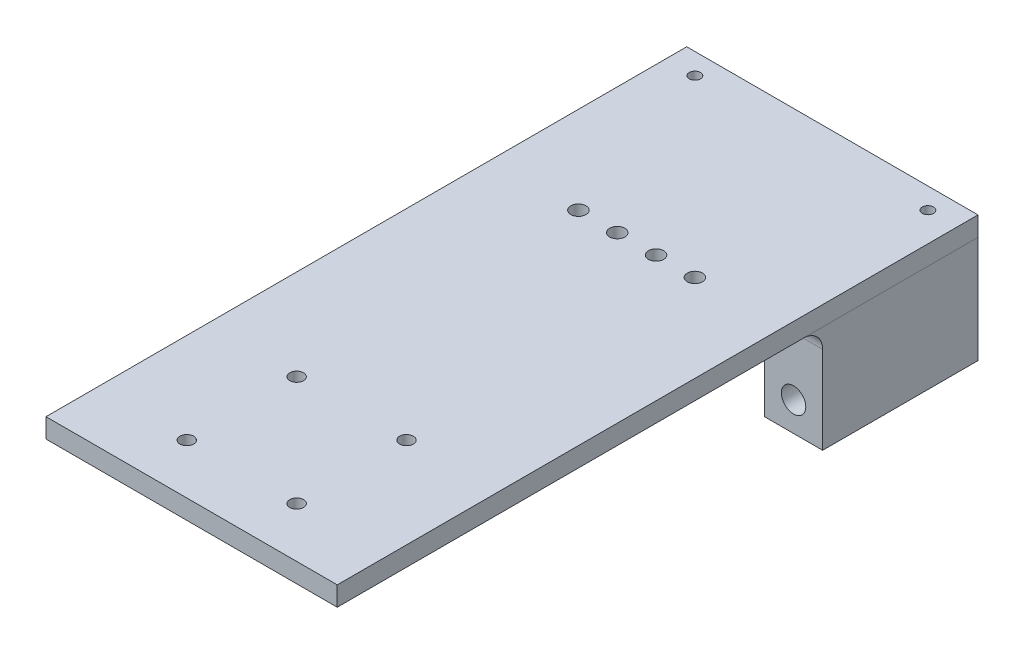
ISO-10303-21;
HEADER;
FILE_DESCRIPTION(('STEP AP214'),'2;1');
FILE_NAME('part.step','',(''),(''),'','','');
FILE_SCHEMA(('AUTOMOTIVE_DESIGN { 1 0 10303 214 1 1 1 1 }'));
ENDSEC;
DATA;
#1=APPLICATION_CONTEXT('core data for automotive mechanical design processes');
#2=APPLICATION_PROTOCOL_DEFINITION('international standard','automotive_design',2000,#1);
#3=PRODUCT_CONTEXT('',#1,'mechanical');
#4=PRODUCT('Part','Part','',(#3));
#5=PRODUCT_RELATED_PRODUCT_CATEGORY('part','',(#4));
#6=PRODUCT_DEFINITION_FORMATION('','',#4);
#7=PRODUCT_DEFINITION_CONTEXT('part definition',#1,'design');
#8=PRODUCT_DEFINITION('design','',#6,#7);
#9=PRODUCT_DEFINITION_SHAPE('','',#8);
#10=(LENGTH_UNIT() NAMED_UNIT(*) SI_UNIT(.MILLI.,.METRE.));
#11=(NAMED_UNIT(*) PLANE_ANGLE_UNIT() SI_UNIT($,.RADIAN.));
#12=(NAMED_UNIT(*) SI_UNIT($,.STERADIAN.) SOLID_ANGLE_UNIT());
#13=UNCERTAINTY_MEASURE_WITH_UNIT(LENGTH_MEASURE(1.E-05),#10,'distance_accuracy_value','');
#14=(GEOMETRIC_REPRESENTATION_CONTEXT(3) GLOBAL_UNCERTAINTY_ASSIGNED_CONTEXT((#13)) GLOBAL_UNIT_ASSIGNED_CONTEXT((#10,
#11,#12)) REPRESENTATION_CONTEXT('',''));
#15=CARTESIAN_POINT('',(0.,0.,0.));
#16=DIRECTION('',(0.,0.,1.));
#17=DIRECTION('',(1.,0.,0.));
#18=AXIS2_PLACEMENT_3D('',#15,#16,#17);
#19=CARTESIAN_POINT('',(-47.625,-6.35,31.7500000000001));
#20=DIRECTION('',(0.,-1.,0.));
#21=DIRECTION('',(0.,0.,-1.));
#22=AXIS2_PLACEMENT_3D('',#19,#20,#21);
#23=PLANE('',#22);
#24=CARTESIAN_POINT('',(-38.1,-6.35,-18.542));
#25=DIRECTION('',(0.,-1.,0.));
#26=DIRECTION('',(0.,0.,-1.));
#27=AXIS2_PLACEMENT_3D('',#24,#25,#26);
#28=CIRCLE('',#27,1.8288);
#29=CARTESIAN_POINT('',(-38.1,-6.35,-20.3708));
#30=VERTEX_POINT('',#29);
#31=EDGE_CURVE('E108',#30,#30,#28,.F.);
#32=ORIENTED_EDGE('',*,*,#31,.T.);
#33=EDGE_LOOP('',(#32));
#34=FACE_BOUND('',#33,.T.);
#35=CARTESIAN_POINT('',(38.1,-6.35,-18.542));
#36=DIRECTION('',(0.,-1.,0.));
#37=DIRECTION('',(0.,0.,-1.));
#38=AXIS2_PLACEMENT_3D('',#35,#36,#37);
#39=CIRCLE('',#38,1.8288);
#40=CARTESIAN_POINT('',(38.1,-6.35,-20.3708));
#41=VERTEX_POINT('',#40);
#42=EDGE_CURVE('E107',#41,#41,#39,.T.);
#43=ORIENTED_EDGE('',*,*,#42,.F.);
#44=EDGE_LOOP('',(#43));
#45=FACE_BOUND('',#44,.T.);
#46=DIRECTION('',(-1.,0.,0.));
#47=VECTOR('',#46,1.);
#48=CARTESIAN_POINT('',(0.,-6.35,-25.4));
#49=LINE('',#48,#47);
#50=CARTESIAN_POINT('',(47.625,-6.35,-25.4));
#51=VERTEX_POINT('',#50);
#52=CARTESIAN_POINT('',(-47.625,-6.35,-25.4));
#53=VERTEX_POINT('',#52);
#54=EDGE_CURVE('E93',#51,#53,#49,.T.);
#55=ORIENTED_EDGE('',*,*,#54,.F.);
#56=DIRECTION('',(0.,0.,-1.));
#57=VECTOR('',#56,1.);
#58=CARTESIAN_POINT('',(47.625,-6.35,184.15));
#59=LINE('',#58,#57);
#60=CARTESIAN_POINT('',(47.625,-6.35,184.15));
#61=VERTEX_POINT('',#60);
#62=EDGE_CURVE('E99',#61,#51,#59,.T.);
#63=ORIENTED_EDGE('',*,*,#62,.F.);
#64=DIRECTION('',(1.,0.,0.));
#65=VECTOR('',#64,1.);
#66=CARTESIAN_POINT('',(-47.625,-6.35,184.15));
#67=LINE('',#66,#65);
#68=CARTESIAN_POINT('',(-47.625,-6.35,184.15));
#69=VERTEX_POINT('',#68);
#70=EDGE_CURVE('E67',#69,#61,#67,.T.);
#71=ORIENTED_EDGE('',*,*,#70,.F.);
#72=DIRECTION('',(0.,0.,-1.));
#73=VECTOR('',#72,1.);
#74=CARTESIAN_POINT('',(-47.625,-6.35,184.15));
#75=LINE('',#74,#73);
#76=EDGE_CURVE('E90',#69,#53,#75,.T.);
#77=ORIENTED_EDGE('',*,*,#76,.T.);
#78=EDGE_LOOP('',(#55,#63,#71,#77));
#79=FACE_BOUND('',#78,.T.);
#80=CARTESIAN_POINT('',(6.34999999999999,-6.35,38.608));
#81=DIRECTION('',(0.,1.,0.));
#82=DIRECTION('',(0.,0.,1.));
#83=AXIS2_PLACEMENT_3D('',#80,#81,#82);
#84=CIRCLE('',#83,2.4892);
#85=CARTESIAN_POINT('',(6.34999999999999,-6.35,41.0972));
#86=VERTEX_POINT('',#85);
#87=EDGE_CURVE('E140',#86,#86,#84,.F.);
#88=ORIENTED_EDGE('',*,*,#87,.F.);
#89=EDGE_LOOP('',(#88));
#90=FACE_BOUND('',#89,.T.);
#91=CARTESIAN_POINT('',(19.05,-6.35,38.608));
#92=DIRECTION('',(0.,1.,0.));
#93=DIRECTION('',(0.,0.,1.));
#94=AXIS2_PLACEMENT_3D('',#91,#92,#93);
#95=CIRCLE('',#94,2.4892);
#96=CARTESIAN_POINT('',(19.05,-6.35,41.0972));
#97=VERTEX_POINT('',#96);
#98=EDGE_CURVE('E129',#97,#97,#95,.F.);
#99=ORIENTED_EDGE('',*,*,#98,.F.);
#100=EDGE_LOOP('',(#99));
#101=FACE_BOUND('',#100,.T.);
#102=CARTESIAN_POINT('',(-6.34999999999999,-6.35,38.608));
#103=DIRECTION('',(0.,1.,0.));
#104=DIRECTION('',(0.,0.,1.));
#105=AXIS2_PLACEMENT_3D('',#102,#103,#104);
#106=CIRCLE('',#105,2.4892);
#107=CARTESIAN_POINT('',(-6.34999999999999,-6.35,41.0972));
#108=VERTEX_POINT('',#107);
#109=EDGE_CURVE('E145',#108,#108,#106,.T.);
#110=ORIENTED_EDGE('',*,*,#109,.T.);
#111=EDGE_LOOP('',(#110));
#112=FACE_BOUND('',#111,.T.);
#113=CARTESIAN_POINT('',(-19.05,-6.35,38.608));
#114=DIRECTION('',(0.,1.,0.));
#115=DIRECTION('',(0.,0.,1.));
#116=AXIS2_PLACEMENT_3D('',#113,#114,#115);
#117=CIRCLE('',#116,2.4892);
#118=CARTESIAN_POINT('',(-19.05,-6.35,41.0972));
#119=VERTEX_POINT('',#118);
#120=EDGE_CURVE('E136',#119,#119,#117,.T.);
#121=ORIENTED_EDGE('',*,*,#120,.T.);
#122=EDGE_LOOP('',(#121));
#123=FACE_BOUND('',#122,.T.);
#124=CARTESIAN_POINT('',(-17.9605122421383,-6.35,131.845975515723));
#125=DIRECTION('',(0.,1.,0.));
#126=DIRECTION('',(0.,0.,1.));
#127=AXIS2_PLACEMENT_3D('',#124,#125,#126);
#128=CIRCLE('',#127,2.24789999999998);
#129=CARTESIAN_POINT('',(-20.2084122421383,-6.35,131.845975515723));
#130=VERTEX_POINT('',#129);
#131=EDGE_CURVE('E156',#130,#130,#128,.F.);
#132=ORIENTED_EDGE('',*,*,#131,.F.);
#133=EDGE_LOOP('',(#132));
#134=FACE_BOUND('',#133,.T.);
#135=CARTESIAN_POINT('',(17.9605122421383,-6.35,167.767));
#136=DIRECTION('',(0.,1.,0.));
#137=DIRECTION('',(0.,0.,1.));
#138=AXIS2_PLACEMENT_3D('',#135,#136,#137);
#139=CIRCLE('',#138,2.24789999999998);
#140=CARTESIAN_POINT('',(15.7126122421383,-6.35,167.767));
#141=VERTEX_POINT('',#140);
#142=EDGE_CURVE('E155',#141,#141,#139,.F.);
#143=ORIENTED_EDGE('',*,*,#142,.F.);
#144=EDGE_LOOP('',(#143));
#145=FACE_BOUND('',#144,.T.);
#146=CARTESIAN_POINT('',(17.9605122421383,-6.35,131.845975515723));
#147=DIRECTION('',(0.,1.,0.));
#148=DIRECTION('',(0.,0.,1.));
#149=AXIS2_PLACEMENT_3D('',#146,#147,#148);
#150=CIRCLE('',#149,2.24789999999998);
#151=CARTESIAN_POINT('',(15.7126122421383,-6.35,131.845975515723));
#152=VERTEX_POINT('',#151);
#153=EDGE_CURVE('E146',#152,#152,#150,.F.);
#154=ORIENTED_EDGE('',*,*,#153,.F.);
#155=EDGE_LOOP('',(#154));
#156=FACE_BOUND('',#155,.T.);
#157=CARTESIAN_POINT('',(-17.9605122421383,-6.35,167.767));
#158=DIRECTION('',(0.,1.,0.));
#159=DIRECTION('',(0.,0.,1.));
#160=AXIS2_PLACEMENT_3D('',#157,#158,#159);
#161=CIRCLE('',#160,2.24789999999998);
#162=CARTESIAN_POINT('',(-20.2084122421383,-6.35,167.767));
#163=VERTEX_POINT('',#162);
#164=EDGE_CURVE('E170',#163,#163,#161,.F.);
#165=ORIENTED_EDGE('',*,*,#164,.F.);
#166=EDGE_LOOP('',(#165));
#167=FACE_BOUND('',#166,.T.);
#168=ADVANCED_FACE('F49',(#34,#45,#79,#90,#101,#112,#123,#134,#145,#156,#167),#23,.T.);
#169=CARTESIAN_POINT('',(0.,0.,-25.4));
#170=DIRECTION('',(0.,0.,-1.));
#171=DIRECTION('',(-1.,0.,0.));
#172=AXIS2_PLACEMENT_3D('',#169,#170,#171);
#173=PLANE('',#172);
#174=DIRECTION('',(0.,1.,0.));
#175=VECTOR('',#174,1.);
#176=CARTESIAN_POINT('',(47.625,0.,-25.4));
#177=LINE('',#176,#175);
#178=CARTESIAN_POINT('',(47.625,0.,-25.4));
#179=VERTEX_POINT('',#178);
#180=EDGE_CURVE('E53',#51,#179,#177,.T.);
#181=ORIENTED_EDGE('',*,*,#180,.F.);
#182=ORIENTED_EDGE('',*,*,#54,.T.);
#183=DIRECTION('',(0.,-1.,0.));
#184=VECTOR('',#183,1.);
#185=CARTESIAN_POINT('',(-47.625,0.,-25.4));
#186=LINE('',#185,#184);
#187=CARTESIAN_POINT('',(-47.625,0.,-25.4));
#188=VERTEX_POINT('',#187);
#189=EDGE_CURVE('E105',#188,#53,#186,.T.);
#190=ORIENTED_EDGE('',*,*,#189,.F.);
#191=DIRECTION('',(-1.,0.,0.));
#192=VECTOR('',#191,1.);
#193=CARTESIAN_POINT('',(-47.625,0.,-25.4));
#194=LINE('',#193,#192);
#195=EDGE_CURVE('E114',#179,#188,#194,.T.);
#196=ORIENTED_EDGE('',*,*,#195,.F.);
#197=EDGE_LOOP('',(#181,#182,#190,#196));
#198=FACE_BOUND('',#197,.T.);
#199=ADVANCED_FACE('F103',(#198),#173,.T.);
#200=CARTESIAN_POINT('',(-47.625,0.,25.4));
#201=DIRECTION('',(0.,-1.,0.));
#202=DIRECTION('',(1.,0.,0.));
#203=AXIS2_PLACEMENT_3D('',#200,#201,#202);
#204=PLANE('',#203);
#205=CARTESIAN_POINT('',(6.35,0.,38.608));
#206=DIRECTION('',(0.,-1.,0.));
#207=DIRECTION('',(1.,0.,0.));
#208=AXIS2_PLACEMENT_3D('',#205,#206,#207);
#209=CIRCLE('',#208,2.4892);
#210=CARTESIAN_POINT('',(8.8392,0.,38.608));
#211=VERTEX_POINT('',#210);
#212=EDGE_CURVE('E59',#211,#211,#209,.T.);
#213=ORIENTED_EDGE('',*,*,#212,.T.);
#214=EDGE_LOOP('',(#213));
#215=FACE_BOUND('',#214,.T.);
#216=CARTESIAN_POINT('',(19.05,0.,38.608));
#217=DIRECTION('',(0.,-1.,0.));
#218=DIRECTION('',(1.,0.,0.));
#219=AXIS2_PLACEMENT_3D('',#216,#217,#218);
#220=CIRCLE('',#219,2.4892);
#221=CARTESIAN_POINT('',(21.5392,0.,38.608));
#222=VERTEX_POINT('',#221);
#223=EDGE_CURVE('E12',#222,#222,#220,.T.);
#224=ORIENTED_EDGE('',*,*,#223,.T.);
#225=EDGE_LOOP('',(#224));
#226=FACE_BOUND('',#225,.T.);
#227=CARTESIAN_POINT('',(-6.35,0.,38.608));
#228=DIRECTION('',(0.,1.,0.));
#229=DIRECTION('',(-1.,0.,0.));
#230=AXIS2_PLACEMENT_3D('',#227,#228,#229);
#231=CIRCLE('',#230,2.4892);
#232=CARTESIAN_POINT('',(-8.8392,0.,38.608));
#233=VERTEX_POINT('',#232);
#234=EDGE_CURVE('E131',#233,#233,#231,.T.);
#235=ORIENTED_EDGE('',*,*,#234,.F.);
#236=EDGE_LOOP('',(#235));
#237=FACE_BOUND('',#236,.T.);
#238=CARTESIAN_POINT('',(-19.05,0.,38.608));
#239=DIRECTION('',(0.,1.,0.));
#240=DIRECTION('',(-1.,0.,0.));
#241=AXIS2_PLACEMENT_3D('',#238,#239,#240);
#242=CIRCLE('',#241,2.4892);
#243=CARTESIAN_POINT('',(-21.5392,0.,38.608));
#244=VERTEX_POINT('',#243);
#245=EDGE_CURVE('E135',#244,#244,#242,.T.);
#246=ORIENTED_EDGE('',*,*,#245,.F.);
#247=EDGE_LOOP('',(#246));
#248=FACE_BOUND('',#247,.T.);
#249=CARTESIAN_POINT('',(-17.9605122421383,0.,131.845975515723));
#250=DIRECTION('',(0.,1.,0.));
#251=DIRECTION('',(-1.,0.,0.));
#252=AXIS2_PLACEMENT_3D('',#249,#250,#251);
#253=CIRCLE('',#252,2.24789999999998);
#254=CARTESIAN_POINT('',(-20.2084122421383,0.,131.845975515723));
#255=VERTEX_POINT('',#254);
#256=EDGE_CURVE('E151',#255,#255,#253,.T.);
#257=ORIENTED_EDGE('',*,*,#256,.F.);
#258=EDGE_LOOP('',(#257));
#259=FACE_BOUND('',#258,.T.);
#260=CARTESIAN_POINT('',(17.9605122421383,0.,167.767));
#261=DIRECTION('',(0.,1.,0.));
#262=DIRECTION('',(-1.,0.,0.));
#263=AXIS2_PLACEMENT_3D('',#260,#261,#262);
#264=CIRCLE('',#263,2.24789999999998);
#265=CARTESIAN_POINT('',(15.7126122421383,0.,167.767));
#266=VERTEX_POINT('',#265);
#267=EDGE_CURVE('E150',#266,#266,#264,.T.);
#268=ORIENTED_EDGE('',*,*,#267,.F.);
#269=EDGE_LOOP('',(#268));
#270=FACE_BOUND('',#269,.T.);
#271=CARTESIAN_POINT('',(17.9605122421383,0.,131.845975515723));
#272=DIRECTION('',(0.,1.,0.));
#273=DIRECTION('',(-1.,0.,0.));
#274=AXIS2_PLACEMENT_3D('',#271,#272,#273);
#275=CIRCLE('',#274,2.24789999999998);
#276=CARTESIAN_POINT('',(15.7126122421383,0.,131.845975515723));
#277=VERTEX_POINT('',#276);
#278=EDGE_CURVE('E141',#277,#277,#275,.T.);
#279=ORIENTED_EDGE('',*,*,#278,.F.);
#280=EDGE_LOOP('',(#279));
#281=FACE_BOUND('',#280,.T.);
#282=CARTESIAN_POINT('',(-17.9605122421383,0.,167.767));
#283=DIRECTION('',(0.,1.,0.));
#284=DIRECTION('',(-1.,0.,0.));
#285=AXIS2_PLACEMENT_3D('',#282,#283,#284);
#286=CIRCLE('',#285,2.24789999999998);
#287=CARTESIAN_POINT('',(-20.2084122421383,0.,167.767));
#288=VERTEX_POINT('',#287);
#289=EDGE_CURVE('E160',#288,#288,#286,.T.);
#290=ORIENTED_EDGE('',*,*,#289,.F.);
#291=EDGE_LOOP('',(#290));
#292=FACE_BOUND('',#291,.T.);
#293=CARTESIAN_POINT('',(38.1,0.,-18.542));
#294=DIRECTION('',(0.,-1.,0.));
#295=DIRECTION('',(1.,0.,0.));
#296=AXIS2_PLACEMENT_3D('',#293,#294,#295);
#297=CIRCLE('',#296,1.8288);
#298=CARTESIAN_POINT('',(39.9288,0.,-18.542));
#299=VERTEX_POINT('',#298);
#300=EDGE_CURVE('E174',#299,#299,#297,.T.);
#301=ORIENTED_EDGE('',*,*,#300,.T.);
#302=EDGE_LOOP('',(#301));
#303=FACE_BOUND('',#302,.T.);
#304=CARTESIAN_POINT('',(-38.1,0.,-18.542));
#305=DIRECTION('',(0.,1.,0.));
#306=DIRECTION('',(-1.,0.,0.));
#307=AXIS2_PLACEMENT_3D('',#304,#305,#306);
#308=CIRCLE('',#307,1.8288);
#309=CARTESIAN_POINT('',(-39.9288,0.,-18.542));
#310=VERTEX_POINT('',#309);
#311=EDGE_CURVE('E178',#310,#310,#308,.T.);
#312=ORIENTED_EDGE('',*,*,#311,.F.);
#313=EDGE_LOOP('',(#312));
#314=FACE_BOUND('',#313,.T.);
#315=ORIENTED_EDGE('',*,*,#195,.T.);
#316=DIRECTION('',(0.,0.,-1.));
#317=VECTOR('',#316,1.);
#318=CARTESIAN_POINT('',(-47.625,0.,25.4));
#319=LINE('',#318,#317);
#320=CARTESIAN_POINT('',(-47.625,0.,184.15));
#321=VERTEX_POINT('',#320);
#322=EDGE_CURVE('E112',#321,#188,#319,.T.);
#323=ORIENTED_EDGE('',*,*,#322,.F.);
#324=DIRECTION('',(-1.,0.,0.));
#325=VECTOR('',#324,1.);
#326=CARTESIAN_POINT('',(-47.625,0.,184.15));
#327=LINE('',#326,#325);
#328=CARTESIAN_POINT('',(47.625,0.,184.15));
#329=VERTEX_POINT('',#328);
#330=EDGE_CURVE('E190',#329,#321,#327,.T.);
#331=ORIENTED_EDGE('',*,*,#330,.F.);
#332=DIRECTION('',(0.,0.,-1.));
#333=VECTOR('',#332,1.);
#334=CARTESIAN_POINT('',(47.625,0.,25.4));
#335=LINE('',#334,#333);
#336=EDGE_CURVE('E118',#329,#179,#335,.T.);
#337=ORIENTED_EDGE('',*,*,#336,.T.);
#338=EDGE_LOOP('',(#315,#323,#331,#337));
#339=FACE_BOUND('',#338,.T.);
#340=ADVANCED_FACE('F240',(#215,#226,#237,#248,#259,#270,#281,#292,#303,#314,#339),#204,.F.);
#341=CARTESIAN_POINT('',(6.34999999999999,-41.275,38.608));
#342=DIRECTION('',(0.,1.,0.));
#343=DIRECTION('',(-1.,0.,0.));
#344=AXIS2_PLACEMENT_3D('',#341,#342,#343);
#345=CYLINDRICAL_SURFACE('',#344,2.4892);
#346=ORIENTED_EDGE('',*,*,#212,.F.);
#347=EDGE_LOOP('',(#346));
#348=FACE_BOUND('',#347,.T.);
#349=ORIENTED_EDGE('',*,*,#87,.T.);
#350=EDGE_LOOP('',(#349));
#351=FACE_BOUND('',#350,.T.);
#352=ADVANCED_FACE('F212',(#348,#351),#345,.F.);
#353=CARTESIAN_POINT('',(19.05,-41.275,38.608));
#354=DIRECTION('',(0.,1.,0.));
#355=DIRECTION('',(-1.,0.,0.));
#356=AXIS2_PLACEMENT_3D('',#353,#354,#355);
#357=CYLINDRICAL_SURFACE('',#356,2.4892);
#358=ORIENTED_EDGE('',*,*,#223,.F.);
#359=EDGE_LOOP('',(#358));
#360=FACE_BOUND('',#359,.T.);
#361=ORIENTED_EDGE('',*,*,#98,.T.);
#362=EDGE_LOOP('',(#361));
#363=FACE_BOUND('',#362,.T.);
#364=ADVANCED_FACE('F321',(#360,#363),#357,.F.);
#365=CARTESIAN_POINT('',(-6.34999999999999,-41.275,38.608));
#366=DIRECTION('',(0.,1.,0.));
#367=DIRECTION('',(-1.,0.,0.));
#368=AXIS2_PLACEMENT_3D('',#365,#366,#367);
#369=CYLINDRICAL_SURFACE('',#368,2.4892);
#370=ORIENTED_EDGE('',*,*,#234,.T.);
#371=EDGE_LOOP('',(#370));
#372=FACE_BOUND('',#371,.T.);
#373=ORIENTED_EDGE('',*,*,#109,.F.);
#374=EDGE_LOOP('',(#373));
#375=FACE_BOUND('',#374,.T.);
#376=ADVANCED_FACE('F331',(#372,#375),#369,.F.);
#377=CARTESIAN_POINT('',(-19.05,-41.275,38.608));
#378=DIRECTION('',(0.,1.,0.));
#379=DIRECTION('',(-1.,0.,0.));
#380=AXIS2_PLACEMENT_3D('',#377,#378,#379);
#381=CYLINDRICAL_SURFACE('',#380,2.4892);
#382=ORIENTED_EDGE('',*,*,#245,.T.);
#383=EDGE_LOOP('',(#382));
#384=FACE_BOUND('',#383,.T.);
#385=ORIENTED_EDGE('',*,*,#120,.F.);
#386=EDGE_LOOP('',(#385));
#387=FACE_BOUND('',#386,.T.);
#388=ADVANCED_FACE('F341',(#384,#387),#381,.F.);
#389=CARTESIAN_POINT('',(-17.9605122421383,-12.7080213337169,131.845975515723));
#390=DIRECTION('',(0.,1.,0.));
#391=DIRECTION('',(-1.,0.,0.));
#392=AXIS2_PLACEMENT_3D('',#389,#390,#391);
#393=CYLINDRICAL_SURFACE('',#392,2.24789999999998);
#394=CARTESIAN_POINT('',(-20.2084122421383,-6.35,131.845975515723));
#395=CARTESIAN_POINT('',(-20.2084122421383,-6.28385416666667,131.845975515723));
#396=CARTESIAN_POINT('',(-20.2084122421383,-6.21770833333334,131.845975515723));
#397=CARTESIAN_POINT('',(-20.2084122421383,-6.08541666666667,131.845975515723));
#398=CARTESIAN_POINT('',(-20.2084122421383,-6.01927083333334,131.845975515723));
#399=CARTESIAN_POINT('',(-20.2084122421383,-5.88697916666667,131.845975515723));
#400=CARTESIAN_POINT('',(-20.2084122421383,-5.82083333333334,131.845975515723));
#401=CARTESIAN_POINT('',(-20.2084122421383,-5.68854166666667,131.845975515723));
#402=CARTESIAN_POINT('',(-20.2084122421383,-5.62239583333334,131.845975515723));
#403=CARTESIAN_POINT('',(-20.2084122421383,-5.49010416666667,131.845975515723));
#404=CARTESIAN_POINT('',(-20.2084122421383,-5.42395833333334,131.845975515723));
#405=CARTESIAN_POINT('',(-20.2084122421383,-5.29166666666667,131.845975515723));
#406=CARTESIAN_POINT('',(-20.2084122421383,-5.22552083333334,131.845975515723));
#407=CARTESIAN_POINT('',(-20.2084122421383,-5.09322916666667,131.845975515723));
#408=CARTESIAN_POINT('',(-20.2084122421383,-5.02708333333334,131.845975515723));
#409=CARTESIAN_POINT('',(-20.2084122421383,-4.89479166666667,131.845975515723));
#410=CARTESIAN_POINT('',(-20.2084122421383,-4.82864583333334,131.845975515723));
#411=CARTESIAN_POINT('',(-20.2084122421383,-4.69635416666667,131.845975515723));
#412=CARTESIAN_POINT('',(-20.2084122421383,-4.63020833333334,131.845975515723));
#413=CARTESIAN_POINT('',(-20.2084122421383,-4.49791666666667,131.845975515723));
#414=CARTESIAN_POINT('',(-20.2084122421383,-4.43177083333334,131.845975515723));
#415=CARTESIAN_POINT('',(-20.2084122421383,-4.29947916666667,131.845975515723));
#416=CARTESIAN_POINT('',(-20.2084122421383,-4.23333333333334,131.845975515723));
#417=CARTESIAN_POINT('',(-20.2084122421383,-4.10104166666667,131.845975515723));
#418=CARTESIAN_POINT('',(-20.2084122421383,-4.03489583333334,131.845975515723));
#419=CARTESIAN_POINT('',(-20.2084122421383,-3.90260416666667,131.845975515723));
#420=CARTESIAN_POINT('',(-20.2084122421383,-3.83645833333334,131.845975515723));
#421=CARTESIAN_POINT('',(-20.2084122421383,-3.70416666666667,131.845975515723));
#422=CARTESIAN_POINT('',(-20.2084122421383,-3.63802083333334,131.845975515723));
#423=CARTESIAN_POINT('',(-20.2084122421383,-3.50572916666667,131.845975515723));
#424=CARTESIAN_POINT('',(-20.2084122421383,-3.43958333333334,131.845975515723));
#425=CARTESIAN_POINT('',(-20.2084122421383,-3.30729166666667,131.845975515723));
#426=CARTESIAN_POINT('',(-20.2084122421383,-3.24114583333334,131.845975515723));
#427=CARTESIAN_POINT('',(-20.2084122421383,-3.10885416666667,131.845975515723));
#428=CARTESIAN_POINT('',(-20.2084122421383,-3.04270833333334,131.845975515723));
#429=CARTESIAN_POINT('',(-20.2084122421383,-2.91041666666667,131.845975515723));
#430=CARTESIAN_POINT('',(-20.2084122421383,-2.84427083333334,131.845975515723));
#431=CARTESIAN_POINT('',(-20.2084122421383,-2.71197916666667,131.845975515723));
#432=CARTESIAN_POINT('',(-20.2084122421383,-2.64583333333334,131.845975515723));
#433=CARTESIAN_POINT('',(-20.2084122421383,-2.51354166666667,131.845975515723));
#434=CARTESIAN_POINT('',(-20.2084122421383,-2.44739583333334,131.845975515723));
#435=CARTESIAN_POINT('',(-20.2084122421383,-2.31510416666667,131.845975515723));
#436=CARTESIAN_POINT('',(-20.2084122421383,-2.24895833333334,131.845975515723));
#437=CARTESIAN_POINT('',(-20.2084122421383,-2.11666666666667,131.845975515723));
#438=CARTESIAN_POINT('',(-20.2084122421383,-2.05052083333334,131.845975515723));
#439=CARTESIAN_POINT('',(-20.2084122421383,-1.91822916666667,131.845975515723));
#440=CARTESIAN_POINT('',(-20.2084122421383,-1.85208333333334,131.845975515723));
#441=CARTESIAN_POINT('',(-20.2084122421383,-1.71979166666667,131.845975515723));
#442=CARTESIAN_POINT('',(-20.2084122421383,-1.65364583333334,131.845975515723));
#443=CARTESIAN_POINT('',(-20.2084122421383,-1.52135416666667,131.845975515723));
#444=CARTESIAN_POINT('',(-20.2084122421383,-1.45520833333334,131.845975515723));
#445=CARTESIAN_POINT('',(-20.2084122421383,-1.32291666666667,131.845975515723));
#446=CARTESIAN_POINT('',(-20.2084122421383,-1.25677083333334,131.845975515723));
#447=CARTESIAN_POINT('',(-20.2084122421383,-1.12447916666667,131.845975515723));
#448=CARTESIAN_POINT('',(-20.2084122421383,-1.05833333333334,131.845975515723));
#449=CARTESIAN_POINT('',(-20.2084122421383,-0.926041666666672,131.845975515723));
#450=CARTESIAN_POINT('',(-20.2084122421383,-0.859895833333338,131.845975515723));
#451=CARTESIAN_POINT('',(-20.2084122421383,-0.727604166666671,131.845975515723));
#452=CARTESIAN_POINT('',(-20.2084122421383,-0.661458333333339,131.845975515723));
#453=CARTESIAN_POINT('',(-20.2084122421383,-0.529166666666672,131.845975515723));
#454=CARTESIAN_POINT('',(-20.2084122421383,-0.463020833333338,131.845975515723));
#455=CARTESIAN_POINT('',(-20.2084122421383,-0.330729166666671,131.845975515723));
#456=CARTESIAN_POINT('',(-20.2084122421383,-0.264583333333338,131.845975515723));
#457=CARTESIAN_POINT('',(-20.2084122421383,-0.132291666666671,131.845975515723));
#458=CARTESIAN_POINT('',(-20.2084122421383,-0.0661458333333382,131.845975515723));
#459=CARTESIAN_POINT('',(-20.2084122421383,0.,131.845975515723));
#460=B_SPLINE_CURVE_WITH_KNOTS('',3,(#394,#395,#396,#397,#398,#399,#400,#401,#402,#403,#404,
#405,#406,#407,#408,#409,#410,#411,#412,#413,#414,#415,#416,#417,#418,#419,#420,#421,#422,#423,
#424,#425,#426,#427,#428,#429,#430,#431,#432,#433,#434,#435,#436,#437,#438,#439,#440,#441,#442,
#443,#444,#445,#446,#447,#448,#449,#450,#451,#452,#453,#454,#455,#456,#457,#458,#459),
.UNSPECIFIED.,.F.,.F.,(4,2,2,2,2,2,2,2,2,2,2,2,2,2,2,2,2,2,2,2,2,2,2,2,2,2,2,2,2,2,2,2,4),(0.,
0.1984375,0.396875,0.595312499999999,0.793749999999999,0.9921875,1.190625,1.3890625,1.5875,
1.7859375,1.984375,2.1828125,2.38125,2.5796875,2.778125,2.9765625,3.175,3.3734375,3.571875,
3.7703125,3.96875,4.1671875,4.365625,4.5640625,4.7625,4.9609375,5.159375,5.3578125,5.55625,
5.7546875,5.953125,6.1515625,6.35),.UNSPECIFIED.);
#461=EDGE_CURVE('BSEAM351',#130,#255,#460,.T.);
#462=ORIENTED_EDGE('',*,*,#131,.T.);
#463=ORIENTED_EDGE('',*,*,#256,.T.);
#464=ORIENTED_EDGE('',*,*,#461,.T.);
#465=ORIENTED_EDGE('',*,*,#461,.F.);
#466=EDGE_LOOP('',(#462,#464,#463,#465));
#467=FACE_BOUND('',#466,.T.);
#468=ADVANCED_FACE('F351',(#467),#393,.F.);
#469=CARTESIAN_POINT('',(17.9605122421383,-12.7080213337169,167.767));
#470=DIRECTION('',(0.,1.,0.));
#471=DIRECTION('',(-1.,0.,0.));
#472=AXIS2_PLACEMENT_3D('',#469,#470,#471);
#473=CYLINDRICAL_SURFACE('',#472,2.24789999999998);
#474=CARTESIAN_POINT('',(15.7126122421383,-6.35,167.767));
#475=CARTESIAN_POINT('',(15.7126122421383,-6.28385416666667,167.767));
#476=CARTESIAN_POINT('',(15.7126122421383,-6.21770833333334,167.767));
#477=CARTESIAN_POINT('',(15.7126122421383,-6.08541666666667,167.767));
#478=CARTESIAN_POINT('',(15.7126122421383,-6.01927083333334,167.767));
#479=CARTESIAN_POINT('',(15.7126122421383,-5.88697916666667,167.767));
#480=CARTESIAN_POINT('',(15.7126122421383,-5.82083333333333,167.767));
#481=CARTESIAN_POINT('',(15.7126122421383,-5.68854166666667,167.767));
#482=CARTESIAN_POINT('',(15.7126122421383,-5.62239583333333,167.767));
#483=CARTESIAN_POINT('',(15.7126122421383,-5.49010416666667,167.767));
#484=CARTESIAN_POINT('',(15.7126122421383,-5.42395833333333,167.767));
#485=CARTESIAN_POINT('',(15.7126122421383,-5.29166666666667,167.767));
#486=CARTESIAN_POINT('',(15.7126122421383,-5.22552083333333,167.767));
#487=CARTESIAN_POINT('',(15.7126122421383,-5.09322916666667,167.767));
#488=CARTESIAN_POINT('',(15.7126122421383,-5.02708333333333,167.767));
#489=CARTESIAN_POINT('',(15.7126122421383,-4.89479166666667,167.767));
#490=CARTESIAN_POINT('',(15.7126122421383,-4.82864583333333,167.767));
#491=CARTESIAN_POINT('',(15.7126122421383,-4.69635416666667,167.767));
#492=CARTESIAN_POINT('',(15.7126122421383,-4.63020833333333,167.767));
#493=CARTESIAN_POINT('',(15.7126122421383,-4.49791666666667,167.767));
#494=CARTESIAN_POINT('',(15.7126122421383,-4.43177083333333,167.767));
#495=CARTESIAN_POINT('',(15.7126122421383,-4.29947916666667,167.767));
#496=CARTESIAN_POINT('',(15.7126122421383,-4.23333333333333,167.767));
#497=CARTESIAN_POINT('',(15.7126122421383,-4.10104166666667,167.767));
#498=CARTESIAN_POINT('',(15.7126122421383,-4.03489583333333,167.767));
#499=CARTESIAN_POINT('',(15.7126122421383,-3.90260416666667,167.767));
#500=CARTESIAN_POINT('',(15.7126122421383,-3.83645833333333,167.767));
#501=CARTESIAN_POINT('',(15.7126122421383,-3.70416666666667,167.767));
#502=CARTESIAN_POINT('',(15.7126122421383,-3.63802083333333,167.767));
#503=CARTESIAN_POINT('',(15.7126122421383,-3.50572916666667,167.767));
#504=CARTESIAN_POINT('',(15.7126122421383,-3.43958333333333,167.767));
#505=CARTESIAN_POINT('',(15.7126122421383,-3.30729166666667,167.767));
#506=CARTESIAN_POINT('',(15.7126122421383,-3.24114583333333,167.767));
#507=CARTESIAN_POINT('',(15.7126122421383,-3.10885416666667,167.767));
#508=CARTESIAN_POINT('',(15.7126122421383,-3.04270833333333,167.767));
#509=CARTESIAN_POINT('',(15.7126122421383,-2.91041666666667,167.767));
#510=CARTESIAN_POINT('',(15.7126122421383,-2.84427083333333,167.767));
#511=CARTESIAN_POINT('',(15.7126122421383,-2.71197916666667,167.767));
#512=CARTESIAN_POINT('',(15.7126122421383,-2.64583333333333,167.767));
#513=CARTESIAN_POINT('',(15.7126122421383,-2.51354166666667,167.767));
#514=CARTESIAN_POINT('',(15.7126122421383,-2.44739583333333,167.767));
#515=CARTESIAN_POINT('',(15.7126122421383,-2.31510416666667,167.767));
#516=CARTESIAN_POINT('',(15.7126122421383,-2.24895833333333,167.767));
#517=CARTESIAN_POINT('',(15.7126122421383,-2.11666666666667,167.767));
#518=CARTESIAN_POINT('',(15.7126122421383,-2.05052083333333,167.767));
#519=CARTESIAN_POINT('',(15.7126122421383,-1.91822916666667,167.767));
#520=CARTESIAN_POINT('',(15.7126122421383,-1.85208333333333,167.767));
#521=CARTESIAN_POINT('',(15.7126122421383,-1.71979166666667,167.767));
#522=CARTESIAN_POINT('',(15.7126122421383,-1.65364583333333,167.767));
#523=CARTESIAN_POINT('',(15.7126122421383,-1.52135416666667,167.767));
#524=CARTESIAN_POINT('',(15.7126122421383,-1.45520833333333,167.767));
#525=CARTESIAN_POINT('',(15.7126122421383,-1.32291666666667,167.767));
#526=CARTESIAN_POINT('',(15.7126122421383,-1.25677083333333,167.767));
#527=CARTESIAN_POINT('',(15.7126122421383,-1.12447916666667,167.767));
#528=CARTESIAN_POINT('',(15.7126122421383,-1.05833333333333,167.767));
#529=CARTESIAN_POINT('',(15.7126122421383,-0.926041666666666,167.767));
#530=CARTESIAN_POINT('',(15.7126122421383,-0.859895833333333,167.767));
#531=CARTESIAN_POINT('',(15.7126122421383,-0.727604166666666,167.767));
#532=CARTESIAN_POINT('',(15.7126122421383,-0.661458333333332,167.767));
#533=CARTESIAN_POINT('',(15.7126122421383,-0.529166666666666,167.767));
#534=CARTESIAN_POINT('',(15.7126122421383,-0.463020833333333,167.767));
#535=CARTESIAN_POINT('',(15.7126122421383,-0.330729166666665,167.767));
#536=CARTESIAN_POINT('',(15.7126122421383,-0.264583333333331,167.767));
#537=CARTESIAN_POINT('',(15.7126122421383,-0.132291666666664,167.767));
#538=CARTESIAN_POINT('',(15.7126122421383,-0.0661458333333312,167.767));
#539=CARTESIAN_POINT('',(15.7126122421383,0.,167.767));
#540=B_SPLINE_CURVE_WITH_KNOTS('',3,(#474,#475,#476,#477,#478,#479,#480,#481,#482,#483,#484,
#485,#486,#487,#488,#489,#490,#491,#492,#493,#494,#495,#496,#497,#498,#499,#500,#501,#502,#503,
#504,#505,#506,#507,#508,#509,#510,#511,#512,#513,#514,#515,#516,#517,#518,#519,#520,#521,#522,
#523,#524,#525,#526,#527,#528,#529,#530,#531,#532,#533,#534,#535,#536,#537,#538,#539),
.UNSPECIFIED.,.F.,.F.,(4,2,2,2,2,2,2,2,2,2,2,2,2,2,2,2,2,2,2,2,2,2,2,2,2,2,2,2,2,2,2,2,4),(0.,
0.1984375,0.396875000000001,0.5953125,0.793750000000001,0.992187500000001,1.190625,1.3890625,
1.5875,1.7859375,1.984375,2.1828125,2.38125,2.5796875,2.778125,2.9765625,3.175,3.3734375,
3.571875,3.7703125,3.96875,4.1671875,4.365625,4.5640625,4.7625,4.9609375,5.159375,5.3578125,
5.55625,5.7546875,5.953125,6.15156250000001,6.35),.UNSPECIFIED.);
#541=EDGE_CURVE('BSEAM361',#141,#266,#540,.T.);
#542=ORIENTED_EDGE('',*,*,#142,.T.);
#543=ORIENTED_EDGE('',*,*,#267,.T.);
#544=ORIENTED_EDGE('',*,*,#541,.T.);
#545=ORIENTED_EDGE('',*,*,#541,.F.);
#546=EDGE_LOOP('',(#542,#544,#543,#545));
#547=FACE_BOUND('',#546,.T.);
#548=ADVANCED_FACE('F361',(#547),#473,.F.);
#549=CARTESIAN_POINT('',(17.9605122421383,-12.7080213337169,131.845975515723));
#550=DIRECTION('',(0.,1.,0.));
#551=DIRECTION('',(-1.,0.,0.));
#552=AXIS2_PLACEMENT_3D('',#549,#550,#551);
#553=CYLINDRICAL_SURFACE('',#552,2.24789999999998);
#554=CARTESIAN_POINT('',(15.7126122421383,-6.35,131.845975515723));
#555=CARTESIAN_POINT('',(15.7126122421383,-6.28385416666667,131.845975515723));
#556=CARTESIAN_POINT('',(15.7126122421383,-6.21770833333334,131.845975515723));
#557=CARTESIAN_POINT('',(15.7126122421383,-6.08541666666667,131.845975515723));
#558=CARTESIAN_POINT('',(15.7126122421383,-6.01927083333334,131.845975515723));
#559=CARTESIAN_POINT('',(15.7126122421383,-5.88697916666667,131.845975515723));
#560=CARTESIAN_POINT('',(15.7126122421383,-5.82083333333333,131.845975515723));
#561=CARTESIAN_POINT('',(15.7126122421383,-5.68854166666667,131.845975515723));
#562=CARTESIAN_POINT('',(15.7126122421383,-5.62239583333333,131.845975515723));
#563=CARTESIAN_POINT('',(15.7126122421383,-5.49010416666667,131.845975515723));
#564=CARTESIAN_POINT('',(15.7126122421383,-5.42395833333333,131.845975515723));
#565=CARTESIAN_POINT('',(15.7126122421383,-5.29166666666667,131.845975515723));
#566=CARTESIAN_POINT('',(15.7126122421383,-5.22552083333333,131.845975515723));
#567=CARTESIAN_POINT('',(15.7126122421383,-5.09322916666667,131.845975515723));
#568=CARTESIAN_POINT('',(15.7126122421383,-5.02708333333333,131.845975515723));
#569=CARTESIAN_POINT('',(15.7126122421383,-4.89479166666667,131.845975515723));
#570=CARTESIAN_POINT('',(15.7126122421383,-4.82864583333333,131.845975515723));
#571=CARTESIAN_POINT('',(15.7126122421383,-4.69635416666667,131.845975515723));
#572=CARTESIAN_POINT('',(15.7126122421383,-4.63020833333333,131.845975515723));
#573=CARTESIAN_POINT('',(15.7126122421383,-4.49791666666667,131.845975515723));
#574=CARTESIAN_POINT('',(15.7126122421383,-4.43177083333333,131.845975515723));
#575=CARTESIAN_POINT('',(15.7126122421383,-4.29947916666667,131.845975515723));
#576=CARTESIAN_POINT('',(15.7126122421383,-4.23333333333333,131.845975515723));
#577=CARTESIAN_POINT('',(15.7126122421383,-4.10104166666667,131.845975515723));
#578=CARTESIAN_POINT('',(15.7126122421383,-4.03489583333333,131.845975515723));
#579=CARTESIAN_POINT('',(15.7126122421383,-3.90260416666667,131.845975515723));
#580=CARTESIAN_POINT('',(15.7126122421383,-3.83645833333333,131.845975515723));
#581=CARTESIAN_POINT('',(15.7126122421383,-3.70416666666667,131.845975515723));
#582=CARTESIAN_POINT('',(15.7126122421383,-3.63802083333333,131.845975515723));
#583=CARTESIAN_POINT('',(15.7126122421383,-3.50572916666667,131.845975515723));
#584=CARTESIAN_POINT('',(15.7126122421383,-3.43958333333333,131.845975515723));
#585=CARTESIAN_POINT('',(15.7126122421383,-3.30729166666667,131.845975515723));
#586=CARTESIAN_POINT('',(15.7126122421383,-3.24114583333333,131.845975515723));
#587=CARTESIAN_POINT('',(15.7126122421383,-3.10885416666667,131.845975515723));
#588=CARTESIAN_POINT('',(15.7126122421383,-3.04270833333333,131.845975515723));
#589=CARTESIAN_POINT('',(15.7126122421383,-2.91041666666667,131.845975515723));
#590=CARTESIAN_POINT('',(15.7126122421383,-2.84427083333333,131.845975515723));
#591=CARTESIAN_POINT('',(15.7126122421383,-2.71197916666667,131.845975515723));
#592=CARTESIAN_POINT('',(15.7126122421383,-2.64583333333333,131.845975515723));
#593=CARTESIAN_POINT('',(15.7126122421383,-2.51354166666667,131.845975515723));
#594=CARTESIAN_POINT('',(15.7126122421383,-2.44739583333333,131.845975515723));
#595=CARTESIAN_POINT('',(15.7126122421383,-2.31510416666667,131.845975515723));
#596=CARTESIAN_POINT('',(15.7126122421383,-2.24895833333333,131.845975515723));
#597=CARTESIAN_POINT('',(15.7126122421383,-2.11666666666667,131.845975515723));
#598=CARTESIAN_POINT('',(15.7126122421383,-2.05052083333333,131.845975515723));
#599=CARTESIAN_POINT('',(15.7126122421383,-1.91822916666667,131.845975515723));
#600=CARTESIAN_POINT('',(15.7126122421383,-1.85208333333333,131.845975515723));
#601=CARTESIAN_POINT('',(15.7126122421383,-1.71979166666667,131.845975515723));
#602=CARTESIAN_POINT('',(15.7126122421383,-1.65364583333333,131.845975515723));
#603=CARTESIAN_POINT('',(15.7126122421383,-1.52135416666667,131.845975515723));
#604=CARTESIAN_POINT('',(15.7126122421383,-1.45520833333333,131.845975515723));
#605=CARTESIAN_POINT('',(15.7126122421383,-1.32291666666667,131.845975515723));
#606=CARTESIAN_POINT('',(15.7126122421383,-1.25677083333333,131.845975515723));
#607=CARTESIAN_POINT('',(15.7126122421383,-1.12447916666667,131.845975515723));
#608=CARTESIAN_POINT('',(15.7126122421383,-1.05833333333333,131.845975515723));
#609=CARTESIAN_POINT('',(15.7126122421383,-0.926041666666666,131.845975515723));
#610=CARTESIAN_POINT('',(15.7126122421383,-0.859895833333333,131.845975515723));
#611=CARTESIAN_POINT('',(15.7126122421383,-0.727604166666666,131.845975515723));
#612=CARTESIAN_POINT('',(15.7126122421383,-0.661458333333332,131.845975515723));
#613=CARTESIAN_POINT('',(15.7126122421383,-0.529166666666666,131.845975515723));
#614=CARTESIAN_POINT('',(15.7126122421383,-0.463020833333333,131.845975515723));
#615=CARTESIAN_POINT('',(15.7126122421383,-0.330729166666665,131.845975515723));
#616=CARTESIAN_POINT('',(15.7126122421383,-0.264583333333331,131.845975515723));
#617=CARTESIAN_POINT('',(15.7126122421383,-0.132291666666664,131.845975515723));
#618=CARTESIAN_POINT('',(15.7126122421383,-0.0661458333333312,131.845975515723));
#619=CARTESIAN_POINT('',(15.7126122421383,0.,131.845975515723));
#620=B_SPLINE_CURVE_WITH_KNOTS('',3,(#554,#555,#556,#557,#558,#559,#560,#561,#562,#563,#564,
#565,#566,#567,#568,#569,#570,#571,#572,#573,#574,#575,#576,#577,#578,#579,#580,#581,#582,#583,
#584,#585,#586,#587,#588,#589,#590,#591,#592,#593,#594,#595,#596,#597,#598,#599,#600,#601,#602,
#603,#604,#605,#606,#607,#608,#609,#610,#611,#612,#613,#614,#615,#616,#617,#618,#619),
.UNSPECIFIED.,.F.,.F.,(4,2,2,2,2,2,2,2,2,2,2,2,2,2,2,2,2,2,2,2,2,2,2,2,2,2,2,2,2,2,2,2,4),(0.,
0.1984375,0.396875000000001,0.5953125,0.793750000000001,0.992187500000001,1.190625,1.3890625,
1.5875,1.7859375,1.984375,2.1828125,2.38125,2.5796875,2.778125,2.9765625,3.175,3.3734375,
3.571875,3.7703125,3.96875,4.1671875,4.365625,4.5640625,4.7625,4.9609375,5.159375,5.3578125,
5.55625,5.7546875,5.953125,6.15156250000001,6.35),.UNSPECIFIED.);
#621=EDGE_CURVE('BSEAM236',#152,#277,#620,.T.);
#622=ORIENTED_EDGE('',*,*,#153,.T.);
#623=ORIENTED_EDGE('',*,*,#278,.T.);
#624=ORIENTED_EDGE('',*,*,#621,.T.);
#625=ORIENTED_EDGE('',*,*,#621,.F.);
#626=EDGE_LOOP('',(#622,#624,#623,#625));
#627=FACE_BOUND('',#626,.T.);
#628=ADVANCED_FACE('F236',(#627),#553,.F.);
#629=CARTESIAN_POINT('',(-17.9605122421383,-12.7080213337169,167.767));
#630=DIRECTION('',(0.,1.,0.));
#631=DIRECTION('',(-1.,0.,0.));
#632=AXIS2_PLACEMENT_3D('',#629,#630,#631);
#633=CYLINDRICAL_SURFACE('',#632,2.24789999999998);
#634=CARTESIAN_POINT('',(-20.2084122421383,-6.35,167.767));
#635=CARTESIAN_POINT('',(-20.2084122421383,-6.28385416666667,167.767));
#636=CARTESIAN_POINT('',(-20.2084122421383,-6.21770833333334,167.767));
#637=CARTESIAN_POINT('',(-20.2084122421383,-6.08541666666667,167.767));
#638=CARTESIAN_POINT('',(-20.2084122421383,-6.01927083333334,167.767));
#639=CARTESIAN_POINT('',(-20.2084122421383,-5.88697916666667,167.767));
#640=CARTESIAN_POINT('',(-20.2084122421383,-5.82083333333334,167.767));
#641=CARTESIAN_POINT('',(-20.2084122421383,-5.68854166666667,167.767));
#642=CARTESIAN_POINT('',(-20.2084122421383,-5.62239583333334,167.767));
#643=CARTESIAN_POINT('',(-20.2084122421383,-5.49010416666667,167.767));
#644=CARTESIAN_POINT('',(-20.2084122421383,-5.42395833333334,167.767));
#645=CARTESIAN_POINT('',(-20.2084122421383,-5.29166666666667,167.767));
#646=CARTESIAN_POINT('',(-20.2084122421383,-5.22552083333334,167.767));
#647=CARTESIAN_POINT('',(-20.2084122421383,-5.09322916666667,167.767));
#648=CARTESIAN_POINT('',(-20.2084122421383,-5.02708333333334,167.767));
#649=CARTESIAN_POINT('',(-20.2084122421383,-4.89479166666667,167.767));
#650=CARTESIAN_POINT('',(-20.2084122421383,-4.82864583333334,167.767));
#651=CARTESIAN_POINT('',(-20.2084122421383,-4.69635416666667,167.767));
#652=CARTESIAN_POINT('',(-20.2084122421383,-4.63020833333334,167.767));
#653=CARTESIAN_POINT('',(-20.2084122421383,-4.49791666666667,167.767));
#654=CARTESIAN_POINT('',(-20.2084122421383,-4.43177083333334,167.767));
#655=CARTESIAN_POINT('',(-20.2084122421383,-4.29947916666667,167.767));
#656=CARTESIAN_POINT('',(-20.2084122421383,-4.23333333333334,167.767));
#657=CARTESIAN_POINT('',(-20.2084122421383,-4.10104166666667,167.767));
#658=CARTESIAN_POINT('',(-20.2084122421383,-4.03489583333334,167.767));
#659=CARTESIAN_POINT('',(-20.2084122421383,-3.90260416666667,167.767));
#660=CARTESIAN_POINT('',(-20.2084122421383,-3.83645833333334,167.767));
#661=CARTESIAN_POINT('',(-20.2084122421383,-3.70416666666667,167.767));
#662=CARTESIAN_POINT('',(-20.2084122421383,-3.63802083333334,167.767));
#663=CARTESIAN_POINT('',(-20.2084122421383,-3.50572916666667,167.767));
#664=CARTESIAN_POINT('',(-20.2084122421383,-3.43958333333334,167.767));
#665=CARTESIAN_POINT('',(-20.2084122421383,-3.30729166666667,167.767));
#666=CARTESIAN_POINT('',(-20.2084122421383,-3.24114583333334,167.767));
#667=CARTESIAN_POINT('',(-20.2084122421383,-3.10885416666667,167.767));
#668=CARTESIAN_POINT('',(-20.2084122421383,-3.04270833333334,167.767));
#669=CARTESIAN_POINT('',(-20.2084122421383,-2.91041666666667,167.767));
#670=CARTESIAN_POINT('',(-20.2084122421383,-2.84427083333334,167.767));
#671=CARTESIAN_POINT('',(-20.2084122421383,-2.71197916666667,167.767));
#672=CARTESIAN_POINT('',(-20.2084122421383,-2.64583333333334,167.767));
#673=CARTESIAN_POINT('',(-20.2084122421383,-2.51354166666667,167.767));
#674=CARTESIAN_POINT('',(-20.2084122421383,-2.44739583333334,167.767));
#675=CARTESIAN_POINT('',(-20.2084122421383,-2.31510416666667,167.767));
#676=CARTESIAN_POINT('',(-20.2084122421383,-2.24895833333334,167.767));
#677=CARTESIAN_POINT('',(-20.2084122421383,-2.11666666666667,167.767));
#678=CARTESIAN_POINT('',(-20.2084122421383,-2.05052083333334,167.767));
#679=CARTESIAN_POINT('',(-20.2084122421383,-1.91822916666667,167.767));
#680=CARTESIAN_POINT('',(-20.2084122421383,-1.85208333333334,167.767));
#681=CARTESIAN_POINT('',(-20.2084122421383,-1.71979166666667,167.767));
#682=CARTESIAN_POINT('',(-20.2084122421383,-1.65364583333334,167.767));
#683=CARTESIAN_POINT('',(-20.2084122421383,-1.52135416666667,167.767));
#684=CARTESIAN_POINT('',(-20.2084122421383,-1.45520833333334,167.767));
#685=CARTESIAN_POINT('',(-20.2084122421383,-1.32291666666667,167.767));
#686=CARTESIAN_POINT('',(-20.2084122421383,-1.25677083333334,167.767));
#687=CARTESIAN_POINT('',(-20.2084122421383,-1.12447916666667,167.767));
#688=CARTESIAN_POINT('',(-20.2084122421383,-1.05833333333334,167.767));
#689=CARTESIAN_POINT('',(-20.2084122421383,-0.926041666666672,167.767));
#690=CARTESIAN_POINT('',(-20.2084122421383,-0.859895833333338,167.767));
#691=CARTESIAN_POINT('',(-20.2084122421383,-0.727604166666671,167.767));
#692=CARTESIAN_POINT('',(-20.2084122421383,-0.661458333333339,167.767));
#693=CARTESIAN_POINT('',(-20.2084122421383,-0.529166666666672,167.767));
#694=CARTESIAN_POINT('',(-20.2084122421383,-0.463020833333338,167.767));
#695=CARTESIAN_POINT('',(-20.2084122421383,-0.330729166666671,167.767));
#696=CARTESIAN_POINT('',(-20.2084122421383,-0.264583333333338,167.767));
#697=CARTESIAN_POINT('',(-20.2084122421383,-0.132291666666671,167.767));
#698=CARTESIAN_POINT('',(-20.2084122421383,-0.0661458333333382,167.767));
#699=CARTESIAN_POINT('',(-20.2084122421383,0.,167.767));
#700=B_SPLINE_CURVE_WITH_KNOTS('',3,(#634,#635,#636,#637,#638,#639,#640,#641,#642,#643,#644,
#645,#646,#647,#648,#649,#650,#651,#652,#653,#654,#655,#656,#657,#658,#659,#660,#661,#662,#663,
#664,#665,#666,#667,#668,#669,#670,#671,#672,#673,#674,#675,#676,#677,#678,#679,#680,#681,#682,
#683,#684,#685,#686,#687,#688,#689,#690,#691,#692,#693,#694,#695,#696,#697,#698,#699),
.UNSPECIFIED.,.F.,.F.,(4,2,2,2,2,2,2,2,2,2,2,2,2,2,2,2,2,2,2,2,2,2,2,2,2,2,2,2,2,2,2,2,4),(0.,
0.1984375,0.396875,0.595312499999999,0.793749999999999,0.9921875,1.190625,1.3890625,1.5875,
1.7859375,1.984375,2.1828125,2.38125,2.5796875,2.778125,2.9765625,3.175,3.3734375,3.571875,
3.7703125,3.96875,4.1671875,4.365625,4.5640625,4.7625,4.9609375,5.159375,5.3578125,5.55625,
5.7546875,5.953125,6.1515625,6.35),.UNSPECIFIED.);
#701=EDGE_CURVE('BSEAM232',#163,#288,#700,.T.);
#702=ORIENTED_EDGE('',*,*,#164,.T.);
#703=ORIENTED_EDGE('',*,*,#289,.T.);
#704=ORIENTED_EDGE('',*,*,#701,.T.);
#705=ORIENTED_EDGE('',*,*,#701,.F.);
#706=EDGE_LOOP('',(#702,#704,#703,#705));
#707=FACE_BOUND('',#706,.T.);
#708=ADVANCED_FACE('F232',(#707),#633,.F.);
#709=CARTESIAN_POINT('',(38.1,-12.7,-18.542));
#710=DIRECTION('',(0.,1.,0.));
#711=DIRECTION('',(-1.,0.,0.));
#712=AXIS2_PLACEMENT_3D('',#709,#710,#711);
#713=CYLINDRICAL_SURFACE('',#712,1.8288);
#714=ORIENTED_EDGE('',*,*,#300,.F.);
#715=EDGE_LOOP('',(#714));
#716=FACE_BOUND('',#715,.T.);
#717=ORIENTED_EDGE('',*,*,#42,.T.);
#718=EDGE_LOOP('',(#717));
#719=FACE_BOUND('',#718,.T.);
#720=ADVANCED_FACE('F235',(#716,#719),#713,.F.);
#721=CARTESIAN_POINT('',(-38.1,-12.7,-18.542));
#722=DIRECTION('',(0.,1.,0.));
#723=DIRECTION('',(-1.,0.,0.));
#724=AXIS2_PLACEMENT_3D('',#721,#722,#723);
#725=CYLINDRICAL_SURFACE('',#724,1.8288);
#726=ORIENTED_EDGE('',*,*,#311,.T.);
#727=EDGE_LOOP('',(#726));
#728=FACE_BOUND('',#727,.T.);
#729=ORIENTED_EDGE('',*,*,#31,.F.);
#730=EDGE_LOOP('',(#729));
#731=FACE_BOUND('',#730,.T.);
#732=ADVANCED_FACE('F51',(#728,#731),#725,.F.);
#733=CARTESIAN_POINT('',(47.625,0.,25.4));
#734=DIRECTION('',(-1.,0.,0.));
#735=DIRECTION('',(0.,-1.,0.));
#736=AXIS2_PLACEMENT_3D('',#733,#734,#735);
#737=PLANE('',#736);
#738=ORIENTED_EDGE('',*,*,#62,.T.);
#739=ORIENTED_EDGE('',*,*,#180,.T.);
#740=ORIENTED_EDGE('',*,*,#336,.F.);
#741=DIRECTION('',(0.,1.,0.));
#742=VECTOR('',#741,1.);
#743=CARTESIAN_POINT('',(47.625,0.,184.15));
#744=LINE('',#743,#742);
#745=EDGE_CURVE('E187',#61,#329,#744,.T.);
#746=ORIENTED_EDGE('',*,*,#745,.F.);
#747=EDGE_LOOP('',(#738,#739,#740,#746));
#748=FACE_BOUND('',#747,.T.);
#749=ADVANCED_FACE('F252',(#748),#737,.F.);
#750=CARTESIAN_POINT('',(-47.625,0.,25.4));
#751=DIRECTION('',(1.,0.,0.));
#752=DIRECTION('',(0.,0.,-1.));
#753=AXIS2_PLACEMENT_3D('',#750,#751,#752);
#754=PLANE('',#753);
#755=ORIENTED_EDGE('',*,*,#189,.T.);
#756=ORIENTED_EDGE('',*,*,#76,.F.);
#757=DIRECTION('',(0.,-1.,0.));
#758=VECTOR('',#757,1.);
#759=CARTESIAN_POINT('',(-47.625,0.,184.15));
#760=LINE('',#759,#758);
#761=EDGE_CURVE('E182',#321,#69,#760,.T.);
#762=ORIENTED_EDGE('',*,*,#761,.F.);
#763=ORIENTED_EDGE('',*,*,#322,.T.);
#764=EDGE_LOOP('',(#755,#756,#762,#763));
#765=FACE_BOUND('',#764,.T.);
#766=ADVANCED_FACE('F111',(#765),#754,.F.);
#767=CARTESIAN_POINT('',(0.,0.,184.15));
#768=DIRECTION('',(0.,0.,1.));
#769=DIRECTION('',(1.,0.,0.));
#770=AXIS2_PLACEMENT_3D('',#767,#768,#769);
#771=PLANE('',#770);
#772=ORIENTED_EDGE('',*,*,#761,.T.);
#773=ORIENTED_EDGE('',*,*,#70,.T.);
#774=ORIENTED_EDGE('',*,*,#745,.T.);
#775=ORIENTED_EDGE('',*,*,#330,.T.);
#776=EDGE_LOOP('',(#772,#773,#774,#775));
#777=FACE_BOUND('',#776,.T.);
#778=ADVANCED_FACE('F217',(#777),#771,.T.);
#779=CLOSED_SHELL('',(#168,#199,#340,#352,#364,#376,#388,#468,#548,#628,#708,#720,#732,#749,
#766,#778));
#780=MANIFOLD_SOLID_BREP('B2',#779);
#781=CARTESIAN_POINT('',(-47.625,-6.35,31.7500000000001));
#782=DIRECTION('',(0.,-1.,0.));
#783=DIRECTION('',(0.,0.,-1.));
#784=AXIS2_PLACEMENT_3D('',#781,#782,#783);
#785=PLANE('',#784);
#786=DIRECTION('',(1.,0.,0.));
#787=VECTOR('',#786,1.);
#788=CARTESIAN_POINT('',(47.625,-6.35,31.75));
#789=LINE('',#788,#787);
#790=CARTESIAN_POINT('',(-47.625,-6.35,31.7500000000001));
#791=VERTEX_POINT('',#790);
#792=CARTESIAN_POINT('',(47.625,-6.35,31.7500000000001));
#793=VERTEX_POINT('',#792);
#794=EDGE_CURVE('E47',#791,#793,#789,.T.);
#795=ORIENTED_EDGE('',*,*,#794,.T.);
#796=DIRECTION('',(0.,0.,1.));
#797=VECTOR('',#796,1.);
#798=CARTESIAN_POINT('',(47.625,-6.35,25.4));
#799=LINE('',#798,#797);
#800=CARTESIAN_POINT('',(47.625,-6.35,-25.4));
#801=VERTEX_POINT('',#800);
#802=EDGE_CURVE('E442',#801,#793,#799,.T.);
#803=ORIENTED_EDGE('',*,*,#802,.F.);
#804=DIRECTION('',(-1.,0.,0.));
#805=VECTOR('',#804,1.);
#806=CARTESIAN_POINT('',(0.,-6.35,-25.4));
#807=LINE('',#806,#805);
#808=CARTESIAN_POINT('',(-47.625,-6.35,-25.4));
#809=VERTEX_POINT('',#808);
#810=EDGE_CURVE('E597',#801,#809,#807,.T.);
#811=ORIENTED_EDGE('',*,*,#810,.T.);
#812=DIRECTION('',(0.,0.,-1.));
#813=VECTOR('',#812,1.);
#814=CARTESIAN_POINT('',(-47.625,-6.35,25.4));
#815=LINE('',#814,#813);
#816=EDGE_CURVE('E448',#791,#809,#815,.T.);
#817=ORIENTED_EDGE('',*,*,#816,.F.);
#818=EDGE_LOOP('',(#795,#803,#811,#817));
#819=FACE_BOUND('',#818,.T.);
#820=CARTESIAN_POINT('',(38.1,-6.35,-18.542));
#821=DIRECTION('',(0.,-1.,0.));
#822=DIRECTION('',(0.,0.,-1.));
#823=AXIS2_PLACEMENT_3D('',#820,#821,#822);
#824=CIRCLE('',#823,1.8288);
#825=CARTESIAN_POINT('',(38.1,-6.35,-20.3708));
#826=VERTEX_POINT('',#825);
#827=EDGE_CURVE('E434',#826,#826,#824,.T.);
#828=ORIENTED_EDGE('',*,*,#827,.T.);
#829=EDGE_LOOP('',(#828));
#830=FACE_BOUND('',#829,.T.);
#831=CARTESIAN_POINT('',(-38.1,-6.35,-18.542));
#832=DIRECTION('',(0.,-1.,0.));
#833=DIRECTION('',(0.,0.,-1.));
#834=AXIS2_PLACEMENT_3D('',#831,#832,#833);
#835=CIRCLE('',#834,1.8288);
#836=CARTESIAN_POINT('',(-38.1,-6.35,-20.3708));
#837=VERTEX_POINT('',#836);
#838=EDGE_CURVE('E429',#837,#837,#835,.F.);
#839=ORIENTED_EDGE('',*,*,#838,.F.);
#840=EDGE_LOOP('',(#839));
#841=FACE_BOUND('',#840,.T.);
#842=ADVANCED_FACE('F426',(#819,#830,#841),#785,.F.);
#843=CARTESIAN_POINT('',(38.1,-31.75,-36.7151227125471));
#844=DIRECTION('',(0.,0.,1.));
#845=DIRECTION('',(1.,0.,0.));
#846=AXIS2_PLACEMENT_3D('',#843,#844,#845);
#847=CYLINDRICAL_SURFACE('',#846,4.00000000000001);
#848=CARTESIAN_POINT('',(38.1,-31.75,25.4));
#849=DIRECTION('',(0.,0.,1.));
#850=DIRECTION('',(1.,0.,0.));
#851=AXIS2_PLACEMENT_3D('',#848,#849,#850);
#852=CIRCLE('',#851,4.00000000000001);
#853=CARTESIAN_POINT('',(42.1,-31.75,25.4));
#854=VERTEX_POINT('',#853);
#855=EDGE_CURVE('E617',#854,#854,#852,.T.);
#856=ORIENTED_EDGE('',*,*,#855,.T.);
#857=EDGE_LOOP('',(#856));
#858=FACE_BOUND('',#857,.T.);
#859=CARTESIAN_POINT('',(38.1,-31.75,-25.4));
#860=DIRECTION('',(0.,0.,-1.));
#861=DIRECTION('',(-1.,0.,0.));
#862=AXIS2_PLACEMENT_3D('',#859,#860,#861);
#863=CIRCLE('',#862,4.00000000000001);
#864=CARTESIAN_POINT('',(34.1,-31.75,-25.4));
#865=VERTEX_POINT('',#864);
#866=EDGE_CURVE('E623',#865,#865,#863,.F.);
#867=ORIENTED_EDGE('',*,*,#866,.F.);
#868=EDGE_LOOP('',(#867));
#869=FACE_BOUND('',#868,.T.);
#870=ADVANCED_FACE('F668',(#858,#869),#847,.F.);
#871=CARTESIAN_POINT('',(-38.1,-31.75,-36.7151227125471));
#872=DIRECTION('',(0.,0.,1.));
#873=DIRECTION('',(1.,0.,0.));
#874=AXIS2_PLACEMENT_3D('',#871,#872,#873);
#875=CYLINDRICAL_SURFACE('',#874,4.00049999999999);
#876=CARTESIAN_POINT('',(-38.1,-31.75,25.4));
#877=DIRECTION('',(0.,0.,1.));
#878=DIRECTION('',(1.,0.,0.));
#879=AXIS2_PLACEMENT_3D('',#876,#877,#878);
#880=CIRCLE('',#879,4.00049999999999);
#881=CARTESIAN_POINT('',(-34.0995,-31.75,25.4));
#882=VERTEX_POINT('',#881);
#883=EDGE_CURVE('E620',#882,#882,#880,.T.);
#884=ORIENTED_EDGE('',*,*,#883,.T.);
#885=EDGE_LOOP('',(#884));
#886=FACE_BOUND('',#885,.T.);
#887=CARTESIAN_POINT('',(-38.1,-31.75,-25.4));
#888=DIRECTION('',(0.,0.,-1.));
#889=DIRECTION('',(-1.,0.,0.));
#890=AXIS2_PLACEMENT_3D('',#887,#888,#889);
#891=CIRCLE('',#890,4.00049999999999);
#892=CARTESIAN_POINT('',(-42.1005,-31.75,-25.4));
#893=VERTEX_POINT('',#892);
#894=EDGE_CURVE('E551',#893,#893,#891,.F.);
#895=ORIENTED_EDGE('',*,*,#894,.F.);
#896=EDGE_LOOP('',(#895));
#897=FACE_BOUND('',#896,.T.);
#898=ADVANCED_FACE('F664',(#886,#897),#875,.F.);
#899=CARTESIAN_POINT('',(-47.625,-41.275,25.4));
#900=DIRECTION('',(0.,1.,0.));
#901=DIRECTION('',(0.,0.,1.));
#902=AXIS2_PLACEMENT_3D('',#899,#900,#901);
#903=PLANE('',#902);
#904=DIRECTION('',(1.,0.,0.));
#905=VECTOR('',#904,1.);
#906=CARTESIAN_POINT('',(-47.625,-41.275,-25.4));
#907=LINE('',#906,#905);
#908=CARTESIAN_POINT('',(-47.625,-41.275,-25.4));
#909=VERTEX_POINT('',#908);
#910=CARTESIAN_POINT('',(-28.575,-41.275,-25.4));
#911=VERTEX_POINT('',#910);
#912=EDGE_CURVE('E553',#909,#911,#907,.T.);
#913=ORIENTED_EDGE('',*,*,#912,.T.);
#914=DIRECTION('',(0.,0.,-1.));
#915=VECTOR('',#914,1.);
#916=CARTESIAN_POINT('',(-28.575,-41.275,25.4));
#917=LINE('',#916,#915);
#918=CARTESIAN_POINT('',(-28.575,-41.275,25.4));
#919=VERTEX_POINT('',#918);
#920=EDGE_CURVE('E531',#919,#911,#917,.T.);
#921=ORIENTED_EDGE('',*,*,#920,.F.);
#922=DIRECTION('',(1.,0.,0.));
#923=VECTOR('',#922,1.);
#924=CARTESIAN_POINT('',(-47.625,-41.275,25.4));
#925=LINE('',#924,#923);
#926=CARTESIAN_POINT('',(-47.625,-41.275,25.4));
#927=VERTEX_POINT('',#926);
#928=EDGE_CURVE('E514',#927,#919,#925,.T.);
#929=ORIENTED_EDGE('',*,*,#928,.F.);
#930=DIRECTION('',(0.,0.,-1.));
#931=VECTOR('',#930,1.);
#932=CARTESIAN_POINT('',(-47.625,-41.275,25.4));
#933=LINE('',#932,#931);
#934=EDGE_CURVE('E524',#927,#909,#933,.T.);
#935=ORIENTED_EDGE('',*,*,#934,.T.);
#936=EDGE_LOOP('',(#913,#921,#929,#935));
#937=FACE_BOUND('',#936,.T.);
#938=ADVANCED_FACE('F533',(#937),#903,.F.);
#939=CARTESIAN_POINT('',(-28.575,-41.275,25.4));
#940=DIRECTION('',(-1.,0.,0.));
#941=DIRECTION('',(0.,-1.,0.));
#942=AXIS2_PLACEMENT_3D('',#939,#940,#941);
#943=PLANE('',#942);
#944=DIRECTION('',(0.,1.,0.));
#945=VECTOR('',#944,1.);
#946=CARTESIAN_POINT('',(-28.575,-41.275,-25.4));
#947=LINE('',#946,#945);
#948=CARTESIAN_POINT('',(-28.575,-19.05,-25.4));
#949=VERTEX_POINT('',#948);
#950=EDGE_CURVE('E555',#911,#949,#947,.T.);
#951=ORIENTED_EDGE('',*,*,#950,.T.);
#952=DIRECTION('',(0.,0.,-1.));
#953=VECTOR('',#952,1.);
#954=CARTESIAN_POINT('',(-28.575,-19.05,25.4));
#955=LINE('',#954,#953);
#956=CARTESIAN_POINT('',(-28.575,-19.05,25.4));
#957=VERTEX_POINT('',#956);
#958=EDGE_CURVE('E579',#949,#957,#955,.F.);
#959=ORIENTED_EDGE('',*,*,#958,.T.);
#960=DIRECTION('',(0.,1.,0.));
#961=VECTOR('',#960,1.);
#962=CARTESIAN_POINT('',(-28.575,-41.275,25.4));
#963=LINE('',#962,#961);
#964=EDGE_CURVE('E536',#919,#957,#963,.T.);
#965=ORIENTED_EDGE('',*,*,#964,.F.);
#966=ORIENTED_EDGE('',*,*,#920,.T.);
#967=EDGE_LOOP('',(#951,#959,#965,#966));
#968=FACE_BOUND('',#967,.T.);
#969=ADVANCED_FACE('F655',(#968),#943,.F.);
#970=CARTESIAN_POINT('',(-22.225,-19.05,25.4));
#971=DIRECTION('',(0.,0.,1.));
#972=DIRECTION('',(1.,0.,0.));
#973=AXIS2_PLACEMENT_3D('',#970,#971,#972);
#974=CYLINDRICAL_SURFACE('',#973,6.35);
#975=CARTESIAN_POINT('',(-22.225,-19.05,25.4));
#976=DIRECTION('',(0.,0.,-1.));
#977=DIRECTION('',(-1.,0.,0.));
#978=AXIS2_PLACEMENT_3D('',#975,#976,#977);
#979=CIRCLE('',#978,6.35);
#980=CARTESIAN_POINT('',(-22.225,-12.7,25.4));
#981=VERTEX_POINT('',#980);
#982=EDGE_CURVE('E587',#957,#981,#979,.T.);
#983=ORIENTED_EDGE('',*,*,#982,.F.);
#984=ORIENTED_EDGE('',*,*,#958,.F.);
#985=CARTESIAN_POINT('',(-22.225,-19.05,-25.4));
#986=DIRECTION('',(0.,0.,-1.));
#987=DIRECTION('',(-1.,0.,0.));
#988=AXIS2_PLACEMENT_3D('',#985,#986,#987);
#989=CIRCLE('',#988,6.35);
#990=CARTESIAN_POINT('',(-22.225,-12.7,-25.4));
#991=VERTEX_POINT('',#990);
#992=EDGE_CURVE('E585',#991,#949,#989,.F.);
#993=ORIENTED_EDGE('',*,*,#992,.F.);
#994=DIRECTION('',(0.,0.,-1.));
#995=VECTOR('',#994,1.);
#996=CARTESIAN_POINT('',(-22.225,-12.7,-25.4));
#997=LINE('',#996,#995);
#998=EDGE_CURVE('E573',#981,#991,#997,.T.);
#999=ORIENTED_EDGE('',*,*,#998,.F.);
#1000=EDGE_LOOP('',(#983,#984,#993,#999));
#1001=FACE_BOUND('',#1000,.T.);
#1002=ADVANCED_FACE('F648',(#1001),#974,.F.);
#1003=CARTESIAN_POINT('',(22.225,-19.05,25.4));
#1004=DIRECTION('',(0.,0.,1.));
#1005=DIRECTION('',(1.,0.,0.));
#1006=AXIS2_PLACEMENT_3D('',#1003,#1004,#1005);
#1007=CYLINDRICAL_SURFACE('',#1006,6.35);
#1008=CARTESIAN_POINT('',(22.225,-19.05,25.4));
#1009=DIRECTION('',(0.,0.,-1.));
#1010=DIRECTION('',(-1.,0.,0.));
#1011=AXIS2_PLACEMENT_3D('',#1008,#1009,#1010);
#1012=CIRCLE('',#1011,6.35);
#1013=CARTESIAN_POINT('',(22.225,-12.7,25.4));
#1014=VERTEX_POINT('',#1013);
#1015=CARTESIAN_POINT('',(28.575,-19.05,25.4));
#1016=VERTEX_POINT('',#1015);
#1017=EDGE_CURVE('E583',#1014,#1016,#1012,.T.);
#1018=ORIENTED_EDGE('',*,*,#1017,.F.);
#1019=DIRECTION('',(0.,0.,-1.));
#1020=VECTOR('',#1019,1.);
#1021=CARTESIAN_POINT('',(22.225,-12.7,25.4));
#1022=LINE('',#1021,#1020);
#1023=CARTESIAN_POINT('',(22.225,-12.7,-25.4));
#1024=VERTEX_POINT('',#1023);
#1025=EDGE_CURVE('E576',#1024,#1014,#1022,.F.);
#1026=ORIENTED_EDGE('',*,*,#1025,.F.);
#1027=CARTESIAN_POINT('',(22.225,-19.05,-25.4));
#1028=DIRECTION('',(0.,0.,-1.));
#1029=DIRECTION('',(-1.,0.,0.));
#1030=AXIS2_PLACEMENT_3D('',#1027,#1028,#1029);
#1031=CIRCLE('',#1030,6.35);
#1032=CARTESIAN_POINT('',(28.575,-19.05,-25.4));
#1033=VERTEX_POINT('',#1032);
#1034=EDGE_CURVE('E581',#1033,#1024,#1031,.F.);
#1035=ORIENTED_EDGE('',*,*,#1034,.F.);
#1036=DIRECTION('',(0.,0.,-1.));
#1037=VECTOR('',#1036,1.);
#1038=CARTESIAN_POINT('',(28.575,-19.05,-25.4));
#1039=LINE('',#1038,#1037);
#1040=EDGE_CURVE('E530',#1016,#1033,#1039,.T.);
#1041=ORIENTED_EDGE('',*,*,#1040,.F.);
#1042=EDGE_LOOP('',(#1018,#1026,#1035,#1041));
#1043=FACE_BOUND('',#1042,.T.);
#1044=ADVANCED_FACE('F662',(#1043),#1007,.F.);
#1045=CARTESIAN_POINT('',(28.575,-41.275,25.4));
#1046=DIRECTION('',(1.,0.,0.));
#1047=DIRECTION('',(0.,1.,0.));
#1048=AXIS2_PLACEMENT_3D('',#1045,#1046,#1047);
#1049=PLANE('',#1048);
#1050=DIRECTION('',(0.,-1.,0.));
#1051=VECTOR('',#1050,1.);
#1052=CARTESIAN_POINT('',(28.575,-41.275,25.4));
#1053=LINE('',#1052,#1051);
#1054=CARTESIAN_POINT('',(28.575,-41.275,25.4));
#1055=VERTEX_POINT('',#1054);
#1056=EDGE_CURVE('E544',#1016,#1055,#1053,.T.);
#1057=ORIENTED_EDGE('',*,*,#1056,.F.);
#1058=ORIENTED_EDGE('',*,*,#1040,.T.);
#1059=DIRECTION('',(0.,-1.,0.));
#1060=VECTOR('',#1059,1.);
#1061=CARTESIAN_POINT('',(28.575,-41.275,-25.4));
#1062=LINE('',#1061,#1060);
#1063=CARTESIAN_POINT('',(28.575,-41.275,-25.4));
#1064=VERTEX_POINT('',#1063);
#1065=EDGE_CURVE('E561',#1033,#1064,#1062,.T.);
#1066=ORIENTED_EDGE('',*,*,#1065,.T.);
#1067=DIRECTION('',(0.,0.,-1.));
#1068=VECTOR('',#1067,1.);
#1069=CARTESIAN_POINT('',(28.575,-41.275,25.4));
#1070=LINE('',#1069,#1068);
#1071=EDGE_CURVE('E567',#1055,#1064,#1070,.T.);
#1072=ORIENTED_EDGE('',*,*,#1071,.F.);
#1073=EDGE_LOOP('',(#1057,#1058,#1066,#1072));
#1074=FACE_BOUND('',#1073,.T.);
#1075=ADVANCED_FACE('F696',(#1074),#1049,.F.);
#1076=CARTESIAN_POINT('',(47.625,-41.275,25.4));
#1077=DIRECTION('',(0.,1.,0.));
#1078=DIRECTION('',(-1.,0.,0.));
#1079=AXIS2_PLACEMENT_3D('',#1076,#1077,#1078);
#1080=PLANE('',#1079);
#1081=DIRECTION('',(1.,0.,0.));
#1082=VECTOR('',#1081,1.);
#1083=CARTESIAN_POINT('',(47.625,-41.275,-25.4));
#1084=LINE('',#1083,#1082);
#1085=CARTESIAN_POINT('',(47.625,-41.275,-25.4));
#1086=VERTEX_POINT('',#1085);
#1087=EDGE_CURVE('E563',#1064,#1086,#1084,.T.);
#1088=ORIENTED_EDGE('',*,*,#1087,.T.);
#1089=DIRECTION('',(0.,0.,-1.));
#1090=VECTOR('',#1089,1.);
#1091=CARTESIAN_POINT('',(47.625,-41.275,25.4));
#1092=LINE('',#1091,#1090);
#1093=CARTESIAN_POINT('',(47.625,-41.275,25.4));
#1094=VERTEX_POINT('',#1093);
#1095=EDGE_CURVE('E548',#1094,#1086,#1092,.T.);
#1096=ORIENTED_EDGE('',*,*,#1095,.F.);
#1097=DIRECTION('',(1.,0.,0.));
#1098=VECTOR('',#1097,1.);
#1099=CARTESIAN_POINT('',(47.625,-41.275,25.4));
#1100=LINE('',#1099,#1098);
#1101=EDGE_CURVE('E546',#1055,#1094,#1100,.T.);
#1102=ORIENTED_EDGE('',*,*,#1101,.F.);
#1103=ORIENTED_EDGE('',*,*,#1071,.T.);
#1104=EDGE_LOOP('',(#1088,#1096,#1102,#1103));
#1105=FACE_BOUND('',#1104,.T.);
#1106=ADVANCED_FACE('F690',(#1105),#1080,.F.);
#1107=CARTESIAN_POINT('',(0.,0.,25.4));
#1108=DIRECTION('',(0.,0.,-1.));
#1109=DIRECTION('',(-1.,0.,0.));
#1110=AXIS2_PLACEMENT_3D('',#1107,#1108,#1109);
#1111=PLANE('',#1110);
#1112=ORIENTED_EDGE('',*,*,#883,.F.);
#1113=EDGE_LOOP('',(#1112));
#1114=FACE_BOUND('',#1113,.T.);
#1115=ORIENTED_EDGE('',*,*,#982,.T.);
#1116=DIRECTION('',(1.,0.,0.));
#1117=VECTOR('',#1116,1.);
#1118=CARTESIAN_POINT('',(-47.625,-12.7,25.4));
#1119=LINE('',#1118,#1117);
#1120=CARTESIAN_POINT('',(-47.625,-12.7,25.4));
#1121=VERTEX_POINT('',#1120);
#1122=EDGE_CURVE('E517',#981,#1121,#1119,.F.);
#1123=ORIENTED_EDGE('',*,*,#1122,.T.);
#1124=DIRECTION('',(0.,-1.,0.));
#1125=VECTOR('',#1124,1.);
#1126=CARTESIAN_POINT('',(-47.625,0.,25.4));
#1127=LINE('',#1126,#1125);
#1128=EDGE_CURVE('E509',#1121,#927,#1127,.T.);
#1129=ORIENTED_EDGE('',*,*,#1128,.T.);
#1130=ORIENTED_EDGE('',*,*,#928,.T.);
#1131=ORIENTED_EDGE('',*,*,#964,.T.);
#1132=EDGE_LOOP('',(#1115,#1123,#1129,#1130,#1131));
#1133=FACE_BOUND('',#1132,.T.);
#1134=ADVANCED_FACE('F511',(#1114,#1133),#1111,.F.);
#1135=CARTESIAN_POINT('',(-47.625,0.,25.4));
#1136=DIRECTION('',(1.,0.,0.));
#1137=DIRECTION('',(0.,0.,-1.));
#1138=AXIS2_PLACEMENT_3D('',#1135,#1136,#1137);
#1139=PLANE('',#1138);
#1140=CARTESIAN_POINT('',(-47.625,-12.7,31.75));
#1141=DIRECTION('',(1.,0.,0.));
#1142=DIRECTION('',(0.,0.,-1.));
#1143=AXIS2_PLACEMENT_3D('',#1140,#1141,#1142);
#1144=CIRCLE('',#1143,6.35);
#1145=EDGE_CURVE('E594',#1121,#791,#1144,.T.);
#1146=ORIENTED_EDGE('',*,*,#1145,.T.);
#1147=ORIENTED_EDGE('',*,*,#816,.T.);
#1148=DIRECTION('',(0.,-1.,0.));
#1149=VECTOR('',#1148,1.);
#1150=CARTESIAN_POINT('',(-47.625,0.,-25.4));
#1151=LINE('',#1150,#1149);
#1152=EDGE_CURVE('E527',#809,#909,#1151,.T.);
#1153=ORIENTED_EDGE('',*,*,#1152,.T.);
#1154=ORIENTED_EDGE('',*,*,#934,.F.);
#1155=ORIENTED_EDGE('',*,*,#1128,.F.);
#1156=EDGE_LOOP('',(#1146,#1147,#1153,#1154,#1155));
#1157=FACE_BOUND('',#1156,.T.);
#1158=ADVANCED_FACE('F525',(#1157),#1139,.F.);
#1159=CARTESIAN_POINT('',(47.625,0.,25.4));
#1160=DIRECTION('',(-1.,0.,0.));
#1161=DIRECTION('',(0.,-1.,0.));
#1162=AXIS2_PLACEMENT_3D('',#1159,#1160,#1161);
#1163=PLANE('',#1162);
#1164=DIRECTION('',(0.,1.,0.));
#1165=VECTOR('',#1164,1.);
#1166=CARTESIAN_POINT('',(47.625,0.,-25.4));
#1167=LINE('',#1166,#1165);
#1168=EDGE_CURVE('E549',#1086,#801,#1167,.T.);
#1169=ORIENTED_EDGE('',*,*,#1168,.T.);
#1170=ORIENTED_EDGE('',*,*,#802,.T.);
#1171=CARTESIAN_POINT('',(47.625,-12.7,31.75));
#1172=DIRECTION('',(-1.,0.,0.));
#1173=DIRECTION('',(0.,-1.,0.));
#1174=AXIS2_PLACEMENT_3D('',#1171,#1172,#1173);
#1175=CIRCLE('',#1174,6.35);
#1176=CARTESIAN_POINT('',(47.625,-12.7,25.4));
#1177=VERTEX_POINT('',#1176);
#1178=EDGE_CURVE('E592',#793,#1177,#1175,.T.);
#1179=ORIENTED_EDGE('',*,*,#1178,.T.);
#1180=DIRECTION('',(0.,1.,0.));
#1181=VECTOR('',#1180,1.);
#1182=CARTESIAN_POINT('',(47.625,0.,25.4));
#1183=LINE('',#1182,#1181);
#1184=EDGE_CURVE('E521',#1094,#1177,#1183,.T.);
#1185=ORIENTED_EDGE('',*,*,#1184,.F.);
#1186=ORIENTED_EDGE('',*,*,#1095,.T.);
#1187=EDGE_LOOP('',(#1169,#1170,#1179,#1185,#1186));
#1188=FACE_BOUND('',#1187,.T.);
#1189=ADVANCED_FACE('F705',(#1188),#1163,.F.);
#1190=ORIENTED_EDGE('',*,*,#855,.F.);
#1191=EDGE_LOOP('',(#1190));
#1192=FACE_BOUND('',#1191,.T.);
#1193=ORIENTED_EDGE('',*,*,#1184,.T.);
#1194=DIRECTION('',(1.,0.,0.));
#1195=VECTOR('',#1194,1.);
#1196=CARTESIAN_POINT('',(-47.625,-12.7,25.4));
#1197=LINE('',#1196,#1195);
#1198=EDGE_CURVE('E590',#1177,#1014,#1197,.F.);
#1199=ORIENTED_EDGE('',*,*,#1198,.T.);
#1200=ORIENTED_EDGE('',*,*,#1017,.T.);
#1201=ORIENTED_EDGE('',*,*,#1056,.T.);
#1202=ORIENTED_EDGE('',*,*,#1101,.T.);
#1203=EDGE_LOOP('',(#1193,#1199,#1200,#1201,#1202));
#1204=FACE_BOUND('',#1203,.T.);
#1205=ADVANCED_FACE('F633',(#1192,#1204),#1111,.F.);
#1206=CARTESIAN_POINT('',(-28.575,-12.7,25.4));
#1207=DIRECTION('',(0.,1.,0.));
#1208=DIRECTION('',(0.,0.,1.));
#1209=AXIS2_PLACEMENT_3D('',#1206,#1207,#1208);
#1210=PLANE('',#1209);
#1211=DIRECTION('',(1.,0.,0.));
#1212=VECTOR('',#1211,1.);
#1213=CARTESIAN_POINT('',(-28.575,-12.7,-25.4));
#1214=LINE('',#1213,#1212);
#1215=EDGE_CURVE('E558',#991,#1024,#1214,.T.);
#1216=ORIENTED_EDGE('',*,*,#1215,.T.);
#1217=ORIENTED_EDGE('',*,*,#1025,.T.);
#1218=DIRECTION('',(1.,0.,0.));
#1219=VECTOR('',#1218,1.);
#1220=CARTESIAN_POINT('',(-28.575,-12.7,25.4));
#1221=LINE('',#1220,#1219);
#1222=EDGE_CURVE('E538',#981,#1014,#1221,.T.);
#1223=ORIENTED_EDGE('',*,*,#1222,.F.);
#1224=ORIENTED_EDGE('',*,*,#998,.T.);
#1225=EDGE_LOOP('',(#1216,#1217,#1223,#1224));
#1226=FACE_BOUND('',#1225,.T.);
#1227=ADVANCED_FACE('F642',(#1226),#1210,.F.);
#1228=CARTESIAN_POINT('',(-47.625,-12.7,31.75));
#1229=DIRECTION('',(-1.,0.,0.));
#1230=DIRECTION('',(0.,0.,1.));
#1231=AXIS2_PLACEMENT_3D('',#1228,#1229,#1230);
#1232=CYLINDRICAL_SURFACE('',#1231,6.35);
#1233=ORIENTED_EDGE('',*,*,#1222,.T.);
#1234=ORIENTED_EDGE('',*,*,#1198,.F.);
#1235=ORIENTED_EDGE('',*,*,#1178,.F.);
#1236=ORIENTED_EDGE('',*,*,#794,.F.);
#1237=ORIENTED_EDGE('',*,*,#1145,.F.);
#1238=ORIENTED_EDGE('',*,*,#1122,.F.);
#1239=EDGE_LOOP('',(#1233,#1234,#1235,#1236,#1237,#1238));
#1240=FACE_BOUND('',#1239,.T.);
#1241=ADVANCED_FACE('F638',(#1240),#1232,.F.);
#1242=CARTESIAN_POINT('',(0.,0.,-25.4));
#1243=DIRECTION('',(0.,0.,-1.));
#1244=DIRECTION('',(-1.,0.,0.));
#1245=AXIS2_PLACEMENT_3D('',#1242,#1243,#1244);
#1246=PLANE('',#1245);
#1247=ORIENTED_EDGE('',*,*,#810,.F.);
#1248=ORIENTED_EDGE('',*,*,#1168,.F.);
#1249=ORIENTED_EDGE('',*,*,#1087,.F.);
#1250=ORIENTED_EDGE('',*,*,#1065,.F.);
#1251=ORIENTED_EDGE('',*,*,#1034,.T.);
#1252=ORIENTED_EDGE('',*,*,#1215,.F.);
#1253=ORIENTED_EDGE('',*,*,#992,.T.);
#1254=ORIENTED_EDGE('',*,*,#950,.F.);
#1255=ORIENTED_EDGE('',*,*,#912,.F.);
#1256=ORIENTED_EDGE('',*,*,#1152,.F.);
#1257=EDGE_LOOP('',(#1247,#1248,#1249,#1250,#1251,#1252,#1253,#1254,#1255,#1256));
#1258=FACE_BOUND('',#1257,.T.);
#1259=ORIENTED_EDGE('',*,*,#894,.T.);
#1260=EDGE_LOOP('',(#1259));
#1261=FACE_BOUND('',#1260,.T.);
#1262=ORIENTED_EDGE('',*,*,#866,.T.);
#1263=EDGE_LOOP('',(#1262));
#1264=FACE_BOUND('',#1263,.T.);
#1265=ADVANCED_FACE('F652',(#1258,#1261,#1264),#1246,.T.);
#1266=CARTESIAN_POINT('',(38.1,-12.7,-18.542));
#1267=DIRECTION('',(0.,1.,0.));
#1268=DIRECTION('',(1.,0.,0.));
#1269=AXIS2_PLACEMENT_3D('',#1266,#1267,#1268);
#1270=PLANE('',#1269);
#1271=CARTESIAN_POINT('',(38.1,-12.7,-18.542));
#1272=DIRECTION('',(0.,-1.,0.));
#1273=DIRECTION('',(1.,0.,0.));
#1274=AXIS2_PLACEMENT_3D('',#1271,#1272,#1273);
#1275=CIRCLE('',#1274,1.8288);
#1276=CARTESIAN_POINT('',(39.9288,-12.7,-18.542));
#1277=VERTEX_POINT('',#1276);
#1278=EDGE_CURVE('E612',#1277,#1277,#1275,.T.);
#1279=ORIENTED_EDGE('',*,*,#1278,.F.);
#1280=EDGE_LOOP('',(#1279));
#1281=FACE_BOUND('',#1280,.T.);
#1282=ADVANCED_FACE('F608',(#1281),#1270,.T.);
#1283=CARTESIAN_POINT('',(38.1,-12.7,-18.542));
#1284=DIRECTION('',(0.,1.,0.));
#1285=DIRECTION('',(-1.,0.,0.));
#1286=AXIS2_PLACEMENT_3D('',#1283,#1284,#1285);
#1287=CYLINDRICAL_SURFACE('',#1286,1.8288);
#1288=ORIENTED_EDGE('',*,*,#827,.F.);
#1289=EDGE_LOOP('',(#1288));
#1290=FACE_BOUND('',#1289,.T.);
#1291=ORIENTED_EDGE('',*,*,#1278,.T.);
#1292=EDGE_LOOP('',(#1291));
#1293=FACE_BOUND('',#1292,.T.);
#1294=ADVANCED_FACE('F604',(#1290,#1293),#1287,.F.);
#1295=CARTESIAN_POINT('',(-38.1,-12.7,-18.542));
#1296=DIRECTION('',(0.,1.,0.));
#1297=DIRECTION('',(-1.,0.,0.));
#1298=AXIS2_PLACEMENT_3D('',#1295,#1296,#1297);
#1299=CYLINDRICAL_SURFACE('',#1298,1.8288);
#1300=ORIENTED_EDGE('',*,*,#838,.T.);
#1301=EDGE_LOOP('',(#1300));
#1302=FACE_BOUND('',#1301,.T.);
#1303=CARTESIAN_POINT('',(-38.1,-12.7,-18.542));
#1304=DIRECTION('',(0.,1.,0.));
#1305=DIRECTION('',(-1.,0.,0.));
#1306=AXIS2_PLACEMENT_3D('',#1303,#1304,#1305);
#1307=CIRCLE('',#1306,1.8288);
#1308=CARTESIAN_POINT('',(-39.9288,-12.7,-18.542));
#1309=VERTEX_POINT('',#1308);
#1310=EDGE_CURVE('E614',#1309,#1309,#1307,.T.);
#1311=ORIENTED_EDGE('',*,*,#1310,.F.);
#1312=EDGE_LOOP('',(#1311));
#1313=FACE_BOUND('',#1312,.T.);
#1314=ADVANCED_FACE('F607',(#1302,#1313),#1299,.F.);
#1315=CARTESIAN_POINT('',(-38.1,-12.7,-18.542));
#1316=DIRECTION('',(0.,1.,0.));
#1317=DIRECTION('',(-1.,0.,0.));
#1318=AXIS2_PLACEMENT_3D('',#1315,#1316,#1317);
#1319=PLANE('',#1318);
#1320=ORIENTED_EDGE('',*,*,#1310,.T.);
#1321=EDGE_LOOP('',(#1320));
#1322=FACE_BOUND('',#1321,.T.);
#1323=ADVANCED_FACE('F669',(#1322),#1319,.T.);
#1324=CLOSED_SHELL('',(#842,#870,#898,#938,#969,#1002,#1044,#1075,#1106,#1134,#1158,#1189,#1205,
#1227,#1241,#1265,#1282,#1294,#1314,#1323));
#1325=MANIFOLD_SOLID_BREP('B6',#1324);
#1326=ADVANCED_BREP_SHAPE_REPRESENTATION('',(#18,#780,#1325),#14);
#1327=SHAPE_DEFINITION_REPRESENTATION(#9,#1326);
ENDSEC;
END-ISO-10303-21;
